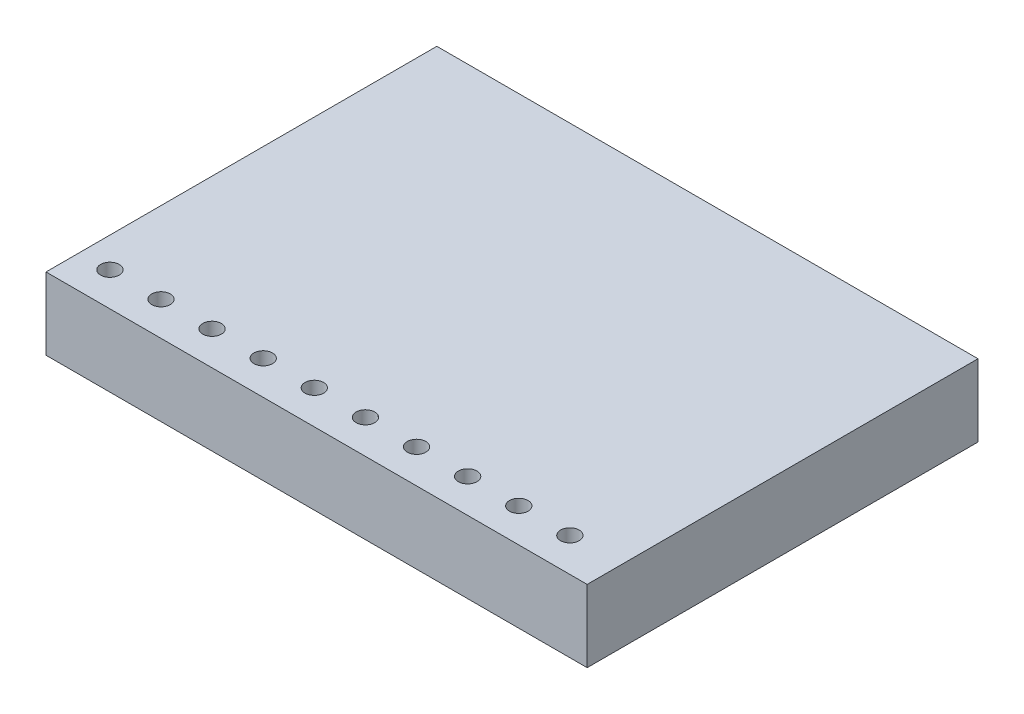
from build123d import *

# Parameters (mm, degrees)
SKIZZE1_W                       = 90
SKIZZE1_H                       = 65
PLATTE_DEPTH                    = 12
SKIZZE2_R                       = 1.546809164
SCHNITT_LINEAR_AUSTRAGEN1_DEPTH = 57.791284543
LINEARES_MUSTER1_COUNT          = 10
LINEARES_MUSTER1_PITCH          = 8.5


with BuildPart() as part:
    # Skizze1 → Platte (new body)
    with BuildSketch(Plane(origin=(0, 0, 0), x_dir=(1, 0, 0), z_dir=(0, 1, 0))):
        Rectangle(SKIZZE1_W, SKIZZE1_H)
    extrude(amount=PLATTE_DEPTH)

    # Skizze2 → Schnitt-Linear austragen1 (cut, through all)
    with BuildSketch(Plane(origin=(0, 12, 0), x_dir=(-1, 0, 0), z_dir=(0, 1, 0))):
        with Locations(Location((40, 26.87538316, 0), (0, 0, 90))):
            Circle(SKIZZE2_R)
    schnitt_linear_austragen1 = extrude(amount=-SCHNITT_LINEAR_AUSTRAGEN1_DEPTH, mode=Mode.SUBTRACT)

    # Lineares Muster1: Schnitt-Linear austragen1 ×10
    with Locations(*[(i * LINEARES_MUSTER1_PITCH, 0, 0) for i in range(1, LINEARES_MUSTER1_COUNT)]):
        add(schnitt_linear_austragen1, mode=Mode.SUBTRACT)


solid = part.part
